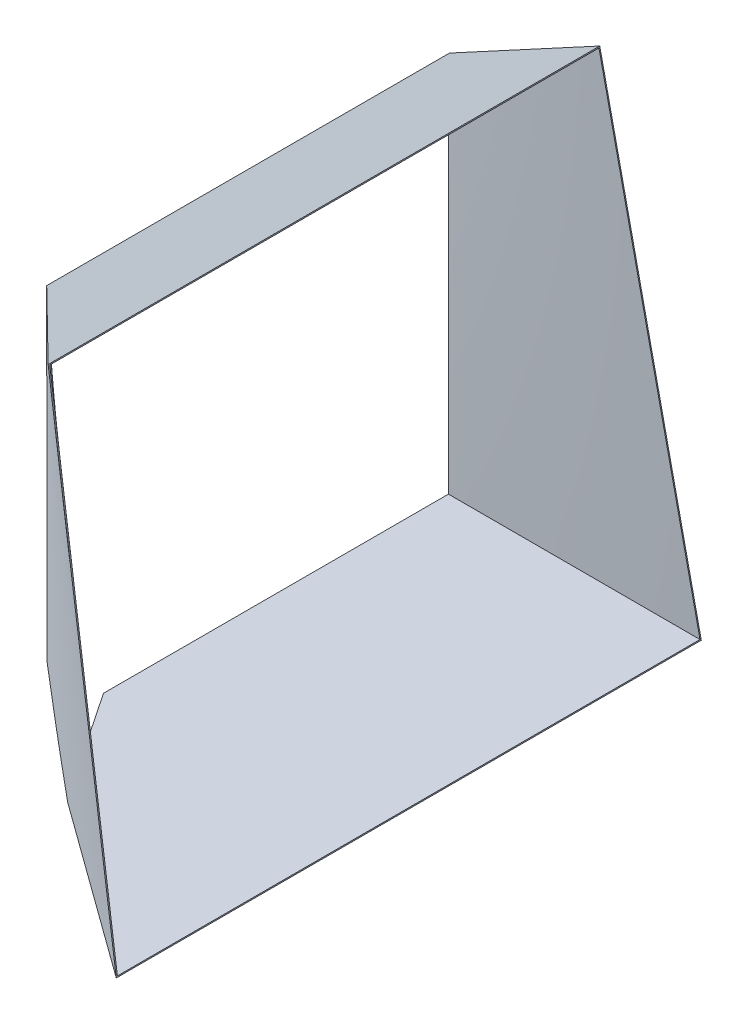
from build123d import *

# Parameters (mm, degrees)
SKIZZE13_W                      = 418.863354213
SKIZZE13_H                      = 270.777404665
SCHNITT_LINEAR_AUSTRAGEN1_DEPTH = 100
WANDUNG2_T                      = 2


with BuildPart() as part:
    # Skizze9 → Ausformung3 section 0
    with BuildSketch(Plane(origin=(1332.920904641, 235.029918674, 0), x_dir=(0, 0, -1), z_dir=(0.9848077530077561, 0.1736481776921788, 0))):
        with BuildLine():
            Line((-533.064512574, 867.676025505), (509.775661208, 867.676025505))
            Line((509.775661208, 867.676025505), (541.485559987, -54.87856506))
            Line((541.485559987, -54.87856506), (-564.774411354, -54.87856506))
            Line((-564.774411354, -54.87856506), (-533.064512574, 867.676025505))
        make_face()
    # Skizze8 → Ausformung3 section 1
    with BuildSketch(Plane.ZY.offset(-880.883595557)):
        with BuildLine():
            Line((-525.355574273, 919.394847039), (234.644425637, 919.394847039))
            Line((234.644425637, 919.394847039), (234.644425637, 197.394847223))
            Line((234.644425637, 197.394847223), (-525.355574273, 197.394847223))
            Line((-525.355574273, 197.394847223), (-525.355574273, 919.394847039))
        make_face()
    loft()

    # Skizze13 → Schnitt-Linear austragen1 (cut)
    with BuildSketch(Plane(origin=(502.623211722, 325.722493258, -325.722493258), x_dir=(-0.40092833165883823, -0.25981962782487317, -0.8784931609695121), z_dir=(0.7372248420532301, 0.47775492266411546, -0.47775492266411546))):
        with Locations((-642.92690172, -357.301415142)):
            Rectangle(SKIZZE13_W, SKIZZE13_H)
    extrude(amount=-SCHNITT_LINEAR_AUSTRAGEN1_DEPTH, mode=Mode.SUBTRACT)

    # Wandung2
    wandung2_openings = [part.faces().sort_by_distance(p)[0] for p in [
        (1263.13842051, 630.786052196, 11.644425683),
        (880.883595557, 561.70311331, -148.856653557),
        (925.292932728, 231.016197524, 231.793937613),
    ]]
    offset(amount=WANDUNG2_T, openings=wandung2_openings, kind=Kind.INTERSECTION)


solid = part.part
